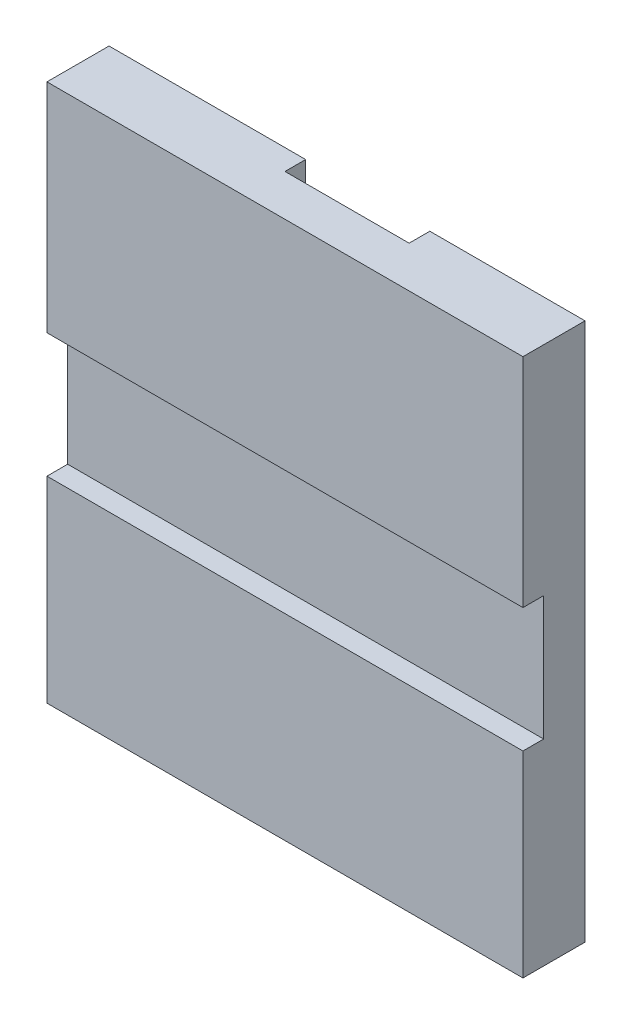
ISO-10303-21;
HEADER;
FILE_DESCRIPTION(('STEP AP214'),'2;1');
FILE_NAME('part.step','',(''),(''),'','','');
FILE_SCHEMA(('AUTOMOTIVE_DESIGN { 1 0 10303 214 1 1 1 1 }'));
ENDSEC;
DATA;
#1=APPLICATION_CONTEXT('core data for automotive mechanical design processes');
#2=APPLICATION_PROTOCOL_DEFINITION('international standard','automotive_design',2000,#1);
#3=PRODUCT_CONTEXT('',#1,'mechanical');
#4=PRODUCT('Part','Part','',(#3));
#5=PRODUCT_RELATED_PRODUCT_CATEGORY('part','',(#4));
#6=PRODUCT_DEFINITION_FORMATION('','',#4);
#7=PRODUCT_DEFINITION_CONTEXT('part definition',#1,'design');
#8=PRODUCT_DEFINITION('design','',#6,#7);
#9=PRODUCT_DEFINITION_SHAPE('','',#8);
#10=(LENGTH_UNIT() NAMED_UNIT(*) SI_UNIT(.MILLI.,.METRE.));
#11=(NAMED_UNIT(*) PLANE_ANGLE_UNIT() SI_UNIT($,.RADIAN.));
#12=(NAMED_UNIT(*) SI_UNIT($,.STERADIAN.) SOLID_ANGLE_UNIT());
#13=UNCERTAINTY_MEASURE_WITH_UNIT(LENGTH_MEASURE(1.E-05),#10,'distance_accuracy_value','');
#14=(GEOMETRIC_REPRESENTATION_CONTEXT(3) GLOBAL_UNCERTAINTY_ASSIGNED_CONTEXT((#13)) GLOBAL_UNIT_ASSIGNED_CONTEXT((#10,
#11,#12)) REPRESENTATION_CONTEXT('',''));
#15=CARTESIAN_POINT('',(0.,0.,0.));
#16=DIRECTION('',(0.,0.,1.));
#17=DIRECTION('',(1.,0.,0.));
#18=AXIS2_PLACEMENT_3D('',#15,#16,#17);
#19=CARTESIAN_POINT('',(0.,520.,60.));
#20=DIRECTION('',(0.,0.,-1.));
#21=DIRECTION('',(-1.,0.,0.));
#22=AXIS2_PLACEMENT_3D('',#19,#20,#21);
#23=PLANE('',#22);
#24=DIRECTION('',(0.,-1.,0.));
#25=VECTOR('',#24,1.);
#26=CARTESIAN_POINT('',(0.,0.,60.));
#27=LINE('',#26,#25);
#28=CARTESIAN_POINT('',(0.,520.,60.));
#29=VERTEX_POINT('',#28);
#30=CARTESIAN_POINT('',(0.,310.,59.9999999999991));
#31=VERTEX_POINT('',#30);
#32=EDGE_CURVE('E169',#29,#31,#27,.T.);
#33=ORIENTED_EDGE('',*,*,#32,.T.);
#34=DIRECTION('',(-1.,0.,0.));
#35=VECTOR('',#34,1.);
#36=CARTESIAN_POINT('',(0.,310.,59.9999999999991));
#37=LINE('',#36,#35);
#38=CARTESIAN_POINT('',(460.,310.,59.9999999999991));
#39=VERTEX_POINT('',#38);
#40=EDGE_CURVE('E120',#39,#31,#37,.T.);
#41=ORIENTED_EDGE('',*,*,#40,.F.);
#42=DIRECTION('',(0.,1.,0.));
#43=VECTOR('',#42,1.);
#44=CARTESIAN_POINT('',(460.,0.,60.));
#45=LINE('',#44,#43);
#46=CARTESIAN_POINT('',(460.,520.,60.));
#47=VERTEX_POINT('',#46);
#48=EDGE_CURVE('E138',#39,#47,#45,.T.);
#49=ORIENTED_EDGE('',*,*,#48,.T.);
#50=DIRECTION('',(-1.,0.,0.));
#51=VECTOR('',#50,1.);
#52=CARTESIAN_POINT('',(0.,520.,60.));
#53=LINE('',#52,#51);
#54=EDGE_CURVE('E137',#47,#29,#53,.T.);
#55=ORIENTED_EDGE('',*,*,#54,.T.);
#56=EDGE_LOOP('',(#33,#41,#49,#55));
#57=FACE_BOUND('',#56,.T.);
#58=ADVANCED_FACE('F26',(#57),#23,.F.);
#59=CARTESIAN_POINT('',(0.,520.,-9.36750677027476E-13));
#60=DIRECTION('',(0.,0.,-1.));
#61=DIRECTION('',(-1.,0.,0.));
#62=AXIS2_PLACEMENT_3D('',#59,#60,#61);
#63=PLANE('',#62);
#64=DIRECTION('',(0.,-1.,0.));
#65=VECTOR('',#64,1.);
#66=CARTESIAN_POINT('',(310.,520.,-9.36750677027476E-13));
#67=LINE('',#66,#65);
#68=CARTESIAN_POINT('',(310.,520.,-9.36750677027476E-13));
#69=VERTEX_POINT('',#68);
#70=CARTESIAN_POINT('',(310.,0.,0.));
#71=VERTEX_POINT('',#70);
#72=EDGE_CURVE('E209',#69,#71,#67,.T.);
#73=ORIENTED_EDGE('',*,*,#72,.F.);
#74=DIRECTION('',(-1.,0.,0.));
#75=VECTOR('',#74,1.);
#76=CARTESIAN_POINT('',(0.,520.,-9.36750677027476E-13));
#77=LINE('',#76,#75);
#78=CARTESIAN_POINT('',(460.,520.,-9.36750677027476E-13));
#79=VERTEX_POINT('',#78);
#80=EDGE_CURVE('E160',#79,#69,#77,.T.);
#81=ORIENTED_EDGE('',*,*,#80,.F.);
#82=DIRECTION('',(0.,1.,0.));
#83=VECTOR('',#82,1.);
#84=CARTESIAN_POINT('',(460.,0.,0.));
#85=LINE('',#84,#83);
#86=CARTESIAN_POINT('',(460.,0.,0.));
#87=VERTEX_POINT('',#86);
#88=EDGE_CURVE('E151',#87,#79,#85,.T.);
#89=ORIENTED_EDGE('',*,*,#88,.F.);
#90=DIRECTION('',(1.,0.,0.));
#91=VECTOR('',#90,1.);
#92=CARTESIAN_POINT('',(0.,0.,0.));
#93=LINE('',#92,#91);
#94=EDGE_CURVE('E158',#71,#87,#93,.T.);
#95=ORIENTED_EDGE('',*,*,#94,.F.);
#96=EDGE_LOOP('',(#73,#81,#89,#95));
#97=FACE_BOUND('',#96,.T.);
#98=ADVANCED_FACE('F157',(#97),#63,.T.);
#99=CARTESIAN_POINT('',(0.,0.,60.));
#100=DIRECTION('',(1.,0.,0.));
#101=DIRECTION('',(0.,0.,-1.));
#102=AXIS2_PLACEMENT_3D('',#99,#100,#101);
#103=PLANE('',#102);
#104=DIRECTION('',(0.,-1.,0.));
#105=VECTOR('',#104,1.);
#106=CARTESIAN_POINT('',(0.,310.,39.9999999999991));
#107=LINE('',#106,#105);
#108=CARTESIAN_POINT('',(0.,310.,39.9999999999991));
#109=VERTEX_POINT('',#108);
#110=CARTESIAN_POINT('',(0.,190.,39.9999999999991));
#111=VERTEX_POINT('',#110);
#112=EDGE_CURVE('E222',#109,#111,#107,.T.);
#113=ORIENTED_EDGE('',*,*,#112,.F.);
#114=DIRECTION('',(0.,0.,1.));
#115=VECTOR('',#114,1.);
#116=CARTESIAN_POINT('',(0.,310.,39.9999999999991));
#117=LINE('',#116,#115);
#118=EDGE_CURVE('E211',#109,#31,#117,.T.);
#119=ORIENTED_EDGE('',*,*,#118,.T.);
#120=ORIENTED_EDGE('',*,*,#32,.F.);
#121=DIRECTION('',(0.,0.,-1.));
#122=VECTOR('',#121,1.);
#123=CARTESIAN_POINT('',(0.,520.,60.));
#124=LINE('',#123,#122);
#125=CARTESIAN_POINT('',(0.,520.,-9.36750677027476E-13));
#126=VERTEX_POINT('',#125);
#127=EDGE_CURVE('E140',#29,#126,#124,.T.);
#128=ORIENTED_EDGE('',*,*,#127,.T.);
#129=DIRECTION('',(0.,-1.,0.));
#130=VECTOR('',#129,1.);
#131=CARTESIAN_POINT('',(0.,0.,0.));
#132=LINE('',#131,#130);
#133=CARTESIAN_POINT('',(0.,0.,0.));
#134=VERTEX_POINT('',#133);
#135=EDGE_CURVE('E181',#126,#134,#132,.T.);
#136=ORIENTED_EDGE('',*,*,#135,.T.);
#137=DIRECTION('',(0.,0.,-1.));
#138=VECTOR('',#137,1.);
#139=CARTESIAN_POINT('',(0.,0.,60.));
#140=LINE('',#139,#138);
#141=CARTESIAN_POINT('',(0.,0.,60.));
#142=VERTEX_POINT('',#141);
#143=EDGE_CURVE('E11',#142,#134,#140,.T.);
#144=ORIENTED_EDGE('',*,*,#143,.F.);
#145=CARTESIAN_POINT('',(0.,190.,59.9999999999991));
#146=VERTEX_POINT('',#145);
#147=EDGE_CURVE('E168',#146,#142,#27,.T.);
#148=ORIENTED_EDGE('',*,*,#147,.F.);
#149=DIRECTION('',(0.,0.,1.));
#150=VECTOR('',#149,1.);
#151=CARTESIAN_POINT('',(0.,190.,39.9999999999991));
#152=LINE('',#151,#150);
#153=EDGE_CURVE('E41',#111,#146,#152,.T.);
#154=ORIENTED_EDGE('',*,*,#153,.F.);
#155=EDGE_LOOP('',(#113,#119,#120,#128,#136,#144,#148,#154));
#156=FACE_BOUND('',#155,.T.);
#157=ADVANCED_FACE('F28',(#156),#103,.F.);
#158=CARTESIAN_POINT('',(0.,0.,60.));
#159=DIRECTION('',(0.,1.,0.));
#160=DIRECTION('',(0.,0.,1.));
#161=AXIS2_PLACEMENT_3D('',#158,#159,#160);
#162=PLANE('',#161);
#163=DIRECTION('',(-1.,0.,0.));
#164=VECTOR('',#163,1.);
#165=CARTESIAN_POINT('',(310.,0.,19.9999999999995));
#166=LINE('',#165,#164);
#167=CARTESIAN_POINT('',(310.,0.,19.9999999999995));
#168=VERTEX_POINT('',#167);
#169=CARTESIAN_POINT('',(190.,0.,19.9999999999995));
#170=VERTEX_POINT('',#169);
#171=EDGE_CURVE('E201',#168,#170,#166,.T.);
#172=ORIENTED_EDGE('',*,*,#171,.F.);
#173=DIRECTION('',(0.,0.,-1.));
#174=VECTOR('',#173,1.);
#175=CARTESIAN_POINT('',(310.,0.,19.9999999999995));
#176=LINE('',#175,#174);
#177=EDGE_CURVE('E189',#168,#71,#176,.T.);
#178=ORIENTED_EDGE('',*,*,#177,.T.);
#179=ORIENTED_EDGE('',*,*,#94,.T.);
#180=DIRECTION('',(0.,0.,-1.));
#181=VECTOR('',#180,1.);
#182=CARTESIAN_POINT('',(460.,0.,60.));
#183=LINE('',#182,#181);
#184=CARTESIAN_POINT('',(460.,0.,60.));
#185=VERTEX_POINT('',#184);
#186=EDGE_CURVE('E34',#185,#87,#183,.T.);
#187=ORIENTED_EDGE('',*,*,#186,.F.);
#188=DIRECTION('',(1.,0.,0.));
#189=VECTOR('',#188,1.);
#190=CARTESIAN_POINT('',(0.,0.,60.));
#191=LINE('',#190,#189);
#192=EDGE_CURVE('E135',#142,#185,#191,.T.);
#193=ORIENTED_EDGE('',*,*,#192,.F.);
#194=ORIENTED_EDGE('',*,*,#143,.T.);
#195=CARTESIAN_POINT('',(190.,0.,0.));
#196=VERTEX_POINT('',#195);
#197=EDGE_CURVE('E162',#134,#196,#93,.T.);
#198=ORIENTED_EDGE('',*,*,#197,.T.);
#199=DIRECTION('',(0.,0.,-1.));
#200=VECTOR('',#199,1.);
#201=CARTESIAN_POINT('',(190.,0.,19.9999999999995));
#202=LINE('',#201,#200);
#203=EDGE_CURVE('E49',#170,#196,#202,.T.);
#204=ORIENTED_EDGE('',*,*,#203,.F.);
#205=EDGE_LOOP('',(#172,#178,#179,#187,#193,#194,#198,#204));
#206=FACE_BOUND('',#205,.T.);
#207=ADVANCED_FACE('F177',(#206),#162,.F.);
#208=CARTESIAN_POINT('',(460.,0.,60.));
#209=DIRECTION('',(-1.,0.,0.));
#210=DIRECTION('',(0.,0.,1.));
#211=AXIS2_PLACEMENT_3D('',#208,#209,#210);
#212=PLANE('',#211);
#213=ORIENTED_EDGE('',*,*,#48,.F.);
#214=DIRECTION('',(0.,0.,1.));
#215=VECTOR('',#214,1.);
#216=CARTESIAN_POINT('',(460.,310.,39.9999999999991));
#217=LINE('',#216,#215);
#218=CARTESIAN_POINT('',(460.,310.,39.9999999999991));
#219=VERTEX_POINT('',#218);
#220=EDGE_CURVE('E131',#219,#39,#217,.T.);
#221=ORIENTED_EDGE('',*,*,#220,.F.);
#222=DIRECTION('',(0.,1.,0.));
#223=VECTOR('',#222,1.);
#224=CARTESIAN_POINT('',(460.,310.,39.9999999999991));
#225=LINE('',#224,#223);
#226=CARTESIAN_POINT('',(460.,190.,39.9999999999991));
#227=VERTEX_POINT('',#226);
#228=EDGE_CURVE('E130',#227,#219,#225,.T.);
#229=ORIENTED_EDGE('',*,*,#228,.F.);
#230=DIRECTION('',(0.,0.,1.));
#231=VECTOR('',#230,1.);
#232=CARTESIAN_POINT('',(460.,190.,39.9999999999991));
#233=LINE('',#232,#231);
#234=CARTESIAN_POINT('',(460.,190.,59.9999999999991));
#235=VERTEX_POINT('',#234);
#236=EDGE_CURVE('E115',#227,#235,#233,.T.);
#237=ORIENTED_EDGE('',*,*,#236,.T.);
#238=EDGE_CURVE('E128',#185,#235,#45,.T.);
#239=ORIENTED_EDGE('',*,*,#238,.F.);
#240=ORIENTED_EDGE('',*,*,#186,.T.);
#241=ORIENTED_EDGE('',*,*,#88,.T.);
#242=DIRECTION('',(0.,0.,-1.));
#243=VECTOR('',#242,1.);
#244=CARTESIAN_POINT('',(460.,520.,60.));
#245=LINE('',#244,#243);
#246=EDGE_CURVE('E147',#47,#79,#245,.T.);
#247=ORIENTED_EDGE('',*,*,#246,.F.);
#248=EDGE_LOOP('',(#213,#221,#229,#237,#239,#240,#241,#247));
#249=FACE_BOUND('',#248,.T.);
#250=ADVANCED_FACE('F126',(#249),#212,.F.);
#251=CARTESIAN_POINT('',(0.,520.,60.));
#252=DIRECTION('',(0.,-1.,0.));
#253=DIRECTION('',(0.,0.,-1.));
#254=AXIS2_PLACEMENT_3D('',#251,#252,#253);
#255=PLANE('',#254);
#256=ORIENTED_EDGE('',*,*,#80,.T.);
#257=DIRECTION('',(0.,0.,-1.));
#258=VECTOR('',#257,1.);
#259=CARTESIAN_POINT('',(310.,520.,19.9999999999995));
#260=LINE('',#259,#258);
#261=CARTESIAN_POINT('',(310.,520.,19.9999999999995));
#262=VERTEX_POINT('',#261);
#263=EDGE_CURVE('E185',#262,#69,#260,.T.);
#264=ORIENTED_EDGE('',*,*,#263,.F.);
#265=DIRECTION('',(1.,0.,0.));
#266=VECTOR('',#265,1.);
#267=CARTESIAN_POINT('',(310.,520.,19.9999999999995));
#268=LINE('',#267,#266);
#269=CARTESIAN_POINT('',(190.,520.,19.9999999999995));
#270=VERTEX_POINT('',#269);
#271=EDGE_CURVE('E192',#270,#262,#268,.T.);
#272=ORIENTED_EDGE('',*,*,#271,.F.);
#273=DIRECTION('',(0.,0.,-1.));
#274=VECTOR('',#273,1.);
#275=CARTESIAN_POINT('',(190.,520.,19.9999999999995));
#276=LINE('',#275,#274);
#277=CARTESIAN_POINT('',(190.,520.,-9.36750677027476E-13));
#278=VERTEX_POINT('',#277);
#279=EDGE_CURVE('E186',#270,#278,#276,.T.);
#280=ORIENTED_EDGE('',*,*,#279,.T.);
#281=EDGE_CURVE('E161',#278,#126,#77,.T.);
#282=ORIENTED_EDGE('',*,*,#281,.T.);
#283=ORIENTED_EDGE('',*,*,#127,.F.);
#284=ORIENTED_EDGE('',*,*,#54,.F.);
#285=ORIENTED_EDGE('',*,*,#246,.T.);
#286=EDGE_LOOP('',(#256,#264,#272,#280,#282,#283,#284,#285));
#287=FACE_BOUND('',#286,.T.);
#288=ADVANCED_FACE('F232',(#287),#255,.F.);
#289=ORIENTED_EDGE('',*,*,#238,.T.);
#290=DIRECTION('',(1.,0.,0.));
#291=VECTOR('',#290,1.);
#292=CARTESIAN_POINT('',(0.,190.,59.9999999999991));
#293=LINE('',#292,#291);
#294=EDGE_CURVE('E112',#146,#235,#293,.T.);
#295=ORIENTED_EDGE('',*,*,#294,.F.);
#296=ORIENTED_EDGE('',*,*,#147,.T.);
#297=ORIENTED_EDGE('',*,*,#192,.T.);
#298=EDGE_LOOP('',(#289,#295,#296,#297));
#299=FACE_BOUND('',#298,.T.);
#300=ADVANCED_FACE('F133',(#299),#23,.F.);
#301=DIRECTION('',(0.,1.,0.));
#302=VECTOR('',#301,1.);
#303=CARTESIAN_POINT('',(190.,520.,-9.36750677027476E-13));
#304=LINE('',#303,#302);
#305=EDGE_CURVE('E207',#196,#278,#304,.T.);
#306=ORIENTED_EDGE('',*,*,#305,.F.);
#307=ORIENTED_EDGE('',*,*,#197,.F.);
#308=ORIENTED_EDGE('',*,*,#135,.F.);
#309=ORIENTED_EDGE('',*,*,#281,.F.);
#310=EDGE_LOOP('',(#306,#307,#308,#309));
#311=FACE_BOUND('',#310,.T.);
#312=ADVANCED_FACE('F234',(#311),#63,.T.);
#313=CARTESIAN_POINT('',(310.,520.,19.9999999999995));
#314=DIRECTION('',(1.,0.,0.));
#315=DIRECTION('',(0.,1.,0.));
#316=AXIS2_PLACEMENT_3D('',#313,#314,#315);
#317=PLANE('',#316);
#318=ORIENTED_EDGE('',*,*,#72,.T.);
#319=ORIENTED_EDGE('',*,*,#177,.F.);
#320=DIRECTION('',(0.,-1.,0.));
#321=VECTOR('',#320,1.);
#322=CARTESIAN_POINT('',(310.,520.,19.9999999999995));
#323=LINE('',#322,#321);
#324=EDGE_CURVE('E204',#262,#168,#323,.T.);
#325=ORIENTED_EDGE('',*,*,#324,.F.);
#326=ORIENTED_EDGE('',*,*,#263,.T.);
#327=EDGE_LOOP('',(#318,#319,#325,#326));
#328=FACE_BOUND('',#327,.T.);
#329=ADVANCED_FACE('F239',(#328),#317,.F.);
#330=CARTESIAN_POINT('',(190.,520.,19.9999999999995));
#331=DIRECTION('',(-1.,0.,0.));
#332=DIRECTION('',(0.,-1.,0.));
#333=AXIS2_PLACEMENT_3D('',#330,#331,#332);
#334=PLANE('',#333);
#335=ORIENTED_EDGE('',*,*,#305,.T.);
#336=ORIENTED_EDGE('',*,*,#279,.F.);
#337=DIRECTION('',(0.,1.,0.));
#338=VECTOR('',#337,1.);
#339=CARTESIAN_POINT('',(190.,520.,19.9999999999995));
#340=LINE('',#339,#338);
#341=EDGE_CURVE('E198',#170,#270,#340,.T.);
#342=ORIENTED_EDGE('',*,*,#341,.F.);
#343=ORIENTED_EDGE('',*,*,#203,.T.);
#344=EDGE_LOOP('',(#335,#336,#342,#343));
#345=FACE_BOUND('',#344,.T.);
#346=ADVANCED_FACE('F241',(#345),#334,.F.);
#347=CARTESIAN_POINT('',(310.,0.,19.9999999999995));
#348=DIRECTION('',(0.,0.,-1.));
#349=DIRECTION('',(-1.,0.,0.));
#350=AXIS2_PLACEMENT_3D('',#347,#348,#349);
#351=PLANE('',#350);
#352=ORIENTED_EDGE('',*,*,#324,.T.);
#353=ORIENTED_EDGE('',*,*,#171,.T.);
#354=ORIENTED_EDGE('',*,*,#341,.T.);
#355=ORIENTED_EDGE('',*,*,#271,.T.);
#356=EDGE_LOOP('',(#352,#353,#354,#355));
#357=FACE_BOUND('',#356,.T.);
#358=ADVANCED_FACE('F236',(#357),#351,.T.);
#359=CARTESIAN_POINT('',(0.,310.,39.9999999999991));
#360=DIRECTION('',(0.,1.,0.));
#361=DIRECTION('',(0.,0.,1.));
#362=AXIS2_PLACEMENT_3D('',#359,#360,#361);
#363=PLANE('',#362);
#364=ORIENTED_EDGE('',*,*,#40,.T.);
#365=ORIENTED_EDGE('',*,*,#118,.F.);
#366=DIRECTION('',(-1.,0.,0.));
#367=VECTOR('',#366,1.);
#368=CARTESIAN_POINT('',(0.,310.,39.9999999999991));
#369=LINE('',#368,#367);
#370=EDGE_CURVE('E212',#219,#109,#369,.T.);
#371=ORIENTED_EDGE('',*,*,#370,.F.);
#372=ORIENTED_EDGE('',*,*,#220,.T.);
#373=EDGE_LOOP('',(#364,#365,#371,#372));
#374=FACE_BOUND('',#373,.T.);
#375=ADVANCED_FACE('F226',(#374),#363,.F.);
#376=CARTESIAN_POINT('',(0.,190.,39.9999999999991));
#377=DIRECTION('',(0.,-1.,0.));
#378=DIRECTION('',(0.,0.,-1.));
#379=AXIS2_PLACEMENT_3D('',#376,#377,#378);
#380=PLANE('',#379);
#381=ORIENTED_EDGE('',*,*,#294,.T.);
#382=ORIENTED_EDGE('',*,*,#236,.F.);
#383=DIRECTION('',(1.,0.,0.));
#384=VECTOR('',#383,1.);
#385=CARTESIAN_POINT('',(0.,190.,39.9999999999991));
#386=LINE('',#385,#384);
#387=EDGE_CURVE('E220',#111,#227,#386,.T.);
#388=ORIENTED_EDGE('',*,*,#387,.F.);
#389=ORIENTED_EDGE('',*,*,#153,.T.);
#390=EDGE_LOOP('',(#381,#382,#388,#389));
#391=FACE_BOUND('',#390,.T.);
#392=ADVANCED_FACE('F114',(#391),#380,.F.);
#393=CARTESIAN_POINT('',(0.,190.,39.9999999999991));
#394=DIRECTION('',(0.,0.,1.));
#395=DIRECTION('',(1.,0.,0.));
#396=AXIS2_PLACEMENT_3D('',#393,#394,#395);
#397=PLANE('',#396);
#398=ORIENTED_EDGE('',*,*,#112,.T.);
#399=ORIENTED_EDGE('',*,*,#387,.T.);
#400=ORIENTED_EDGE('',*,*,#228,.T.);
#401=ORIENTED_EDGE('',*,*,#370,.T.);
#402=EDGE_LOOP('',(#398,#399,#400,#401));
#403=FACE_BOUND('',#402,.T.);
#404=ADVANCED_FACE('F229',(#403),#397,.T.);
#405=CLOSED_SHELL('',(#58,#98,#157,#207,#250,#288,#300,#312,#329,#346,#358,#375,#392,#404));
#406=MANIFOLD_SOLID_BREP('B2',#405);
#407=ADVANCED_BREP_SHAPE_REPRESENTATION('',(#18,#406),#14);
#408=SHAPE_DEFINITION_REPRESENTATION(#9,#407);
ENDSEC;
END-ISO-10303-21;
